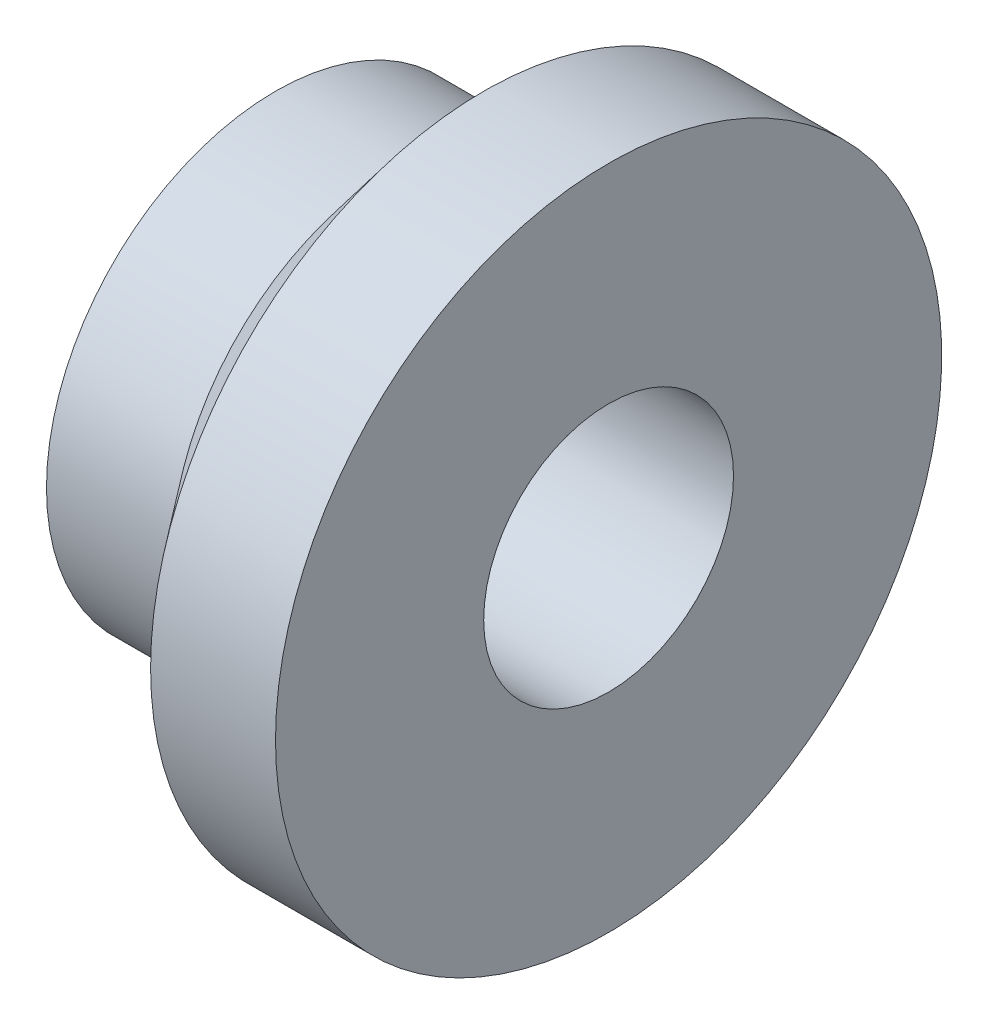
from build123d import *


with BuildPart() as part:
    # Esquisse1 → R_volution1 (revolve)
    with BuildSketch(Plane.XY, mode=Mode.PRIVATE) as r_volution1_sk:
        Polygon((0, 1.5), (4, 1.5), (4, 4), (2.5, 4), (1.5, 2.75), (0, 2.75), align=None)
    revolve(r_volution1_sk.sketch.rotate(Axis((0, 0, 0), (1, 0, 0)), 90), axis=Axis((0, 0, 0), (1, 0, 0)))


solid = part.part
